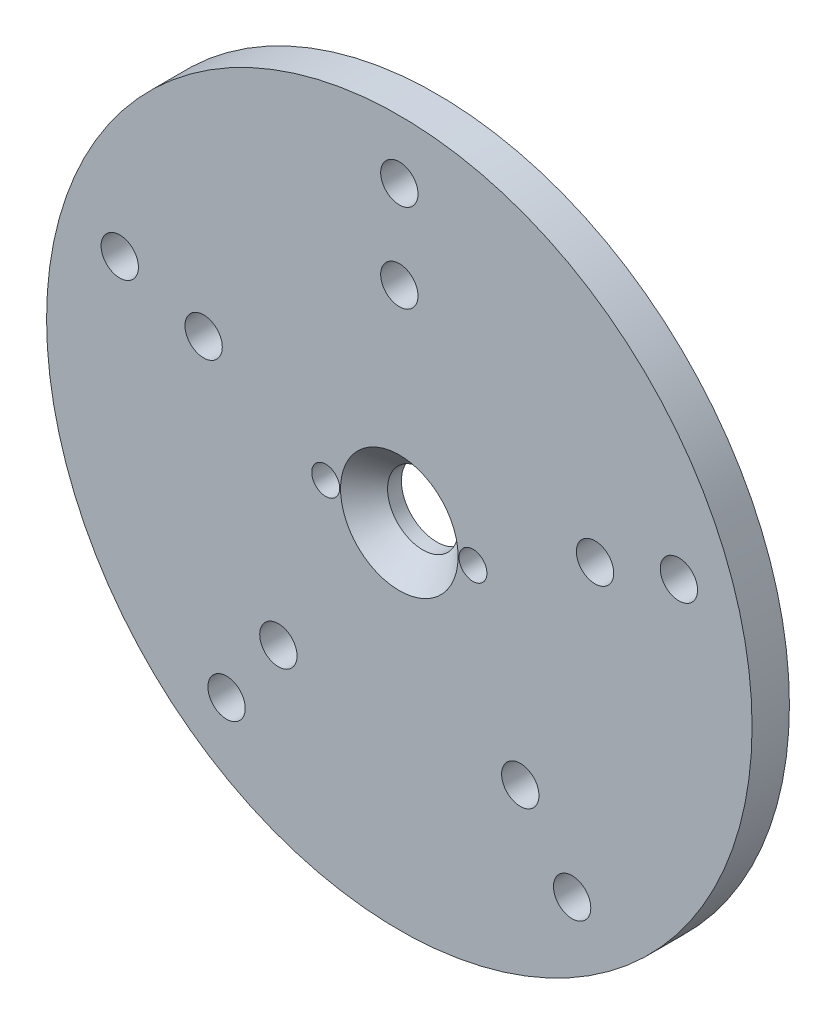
ISO-10303-21;
HEADER;
FILE_DESCRIPTION(('STEP AP214'),'2;1');
FILE_NAME('part.step','',(''),(''),'','','');
FILE_SCHEMA(('AUTOMOTIVE_DESIGN { 1 0 10303 214 1 1 1 1 }'));
ENDSEC;
DATA;
#1=APPLICATION_CONTEXT('core data for automotive mechanical design processes');
#2=APPLICATION_PROTOCOL_DEFINITION('international standard','automotive_design',2000,#1);
#3=PRODUCT_CONTEXT('',#1,'mechanical');
#4=PRODUCT('Part','Part','',(#3));
#5=PRODUCT_RELATED_PRODUCT_CATEGORY('part','',(#4));
#6=PRODUCT_DEFINITION_FORMATION('','',#4);
#7=PRODUCT_DEFINITION_CONTEXT('part definition',#1,'design');
#8=PRODUCT_DEFINITION('design','',#6,#7);
#9=PRODUCT_DEFINITION_SHAPE('','',#8);
#10=(LENGTH_UNIT() NAMED_UNIT(*) SI_UNIT(.MILLI.,.METRE.));
#11=(NAMED_UNIT(*) PLANE_ANGLE_UNIT() SI_UNIT($,.RADIAN.));
#12=(NAMED_UNIT(*) SI_UNIT($,.STERADIAN.) SOLID_ANGLE_UNIT());
#13=UNCERTAINTY_MEASURE_WITH_UNIT(LENGTH_MEASURE(1.E-05),#10,'distance_accuracy_value','');
#14=(GEOMETRIC_REPRESENTATION_CONTEXT(3) GLOBAL_UNCERTAINTY_ASSIGNED_CONTEXT((#13)) GLOBAL_UNIT_ASSIGNED_CONTEXT((#10,
#11,#12)) REPRESENTATION_CONTEXT('',''));
#15=CARTESIAN_POINT('',(0.,0.,0.));
#16=DIRECTION('',(0.,0.,1.));
#17=DIRECTION('',(1.,0.,0.));
#18=AXIS2_PLACEMENT_3D('',#15,#16,#17);
#19=CARTESIAN_POINT('',(0.,0.,6.35));
#20=DIRECTION('',(0.,0.,1.));
#21=DIRECTION('',(1.,0.,0.));
#22=AXIS2_PLACEMENT_3D('',#19,#20,#21);
#23=PLANE('',#22);
#24=CARTESIAN_POINT('',(-33.2869780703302,10.8155948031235,6.35));
#25=DIRECTION('',(0.,0.,1.));
#26=DIRECTION('',(0.309016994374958,0.95105651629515,0.));
#27=AXIS2_PLACEMENT_3D('',#24,#25,#26);
#28=CIRCLE('',#27,3.175);
#29=CARTESIAN_POINT('',(-32.3058491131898,13.8351992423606,6.35));
#30=VERTEX_POINT('',#29);
#31=EDGE_CURVE('E117',#30,#30,#28,.T.);
#32=ORIENTED_EDGE('',*,*,#31,.F.);
#33=EDGE_LOOP('',(#32));
#34=FACE_BOUND('',#33,.T.);
#35=CARTESIAN_POINT('',(-47.5528258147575,15.4508497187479,6.35));
#36=DIRECTION('',(0.,0.,1.));
#37=DIRECTION('',(0.309016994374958,0.95105651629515,0.));
#38=AXIS2_PLACEMENT_3D('',#35,#36,#37);
#39=CIRCLE('',#38,3.175);
#40=CARTESIAN_POINT('',(-46.571696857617,18.470454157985,6.35));
#41=VERTEX_POINT('',#40);
#42=EDGE_CURVE('E111',#41,#41,#39,.T.);
#43=ORIENTED_EDGE('',*,*,#42,.F.);
#44=EDGE_LOOP('',(#43));
#45=FACE_BOUND('',#44,.T.);
#46=CARTESIAN_POINT('',(-20.5724838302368,-28.315594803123,6.35));
#47=DIRECTION('',(0.,0.,1.));
#48=DIRECTION('',(-0.809016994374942,0.58778525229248,0.));
#49=AXIS2_PLACEMENT_3D('',#46,#47,#48);
#50=CIRCLE('',#49,3.175);
#51=CARTESIAN_POINT('',(-23.1411127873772,-26.4493766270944,6.35));
#52=VERTEX_POINT('',#51);
#53=EDGE_CURVE('E105',#52,#52,#50,.T.);
#54=ORIENTED_EDGE('',*,*,#53,.F.);
#55=EDGE_LOOP('',(#54));
#56=FACE_BOUND('',#55,.T.);
#57=CARTESIAN_POINT('',(-29.389262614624,-40.4508497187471,6.35));
#58=DIRECTION('',(0.,0.,1.));
#59=DIRECTION('',(-0.809016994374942,0.58778525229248,0.));
#60=AXIS2_PLACEMENT_3D('',#57,#58,#59);
#61=CIRCLE('',#60,3.175);
#62=CARTESIAN_POINT('',(-31.9578915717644,-38.5846315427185,6.35));
#63=VERTEX_POINT('',#62);
#64=EDGE_CURVE('E99',#63,#63,#61,.T.);
#65=ORIENTED_EDGE('',*,*,#64,.F.);
#66=EDGE_LOOP('',(#65));
#67=FACE_BOUND('',#66,.T.);
#68=CARTESIAN_POINT('',(20.5724838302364,-28.3155948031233,6.35));
#69=DIRECTION('',(0.,0.,1.));
#70=DIRECTION('',(-0.809016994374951,-0.587785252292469,0.));
#71=AXIS2_PLACEMENT_3D('',#68,#69,#70);
#72=CIRCLE('',#71,3.175);
#73=CARTESIAN_POINT('',(18.0038548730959,-30.1818129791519,6.35));
#74=VERTEX_POINT('',#73);
#75=EDGE_CURVE('E93',#74,#74,#72,.T.);
#76=ORIENTED_EDGE('',*,*,#75,.F.);
#77=EDGE_LOOP('',(#76));
#78=FACE_BOUND('',#77,.T.);
#79=CARTESIAN_POINT('',(29.3892626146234,-40.4508497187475,6.35));
#80=DIRECTION('',(0.,0.,1.));
#81=DIRECTION('',(-0.809016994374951,-0.587785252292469,0.));
#82=AXIS2_PLACEMENT_3D('',#79,#80,#81);
#83=CIRCLE('',#82,3.175);
#84=CARTESIAN_POINT('',(26.820633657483,-42.3170678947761,6.35));
#85=VERTEX_POINT('',#84);
#86=EDGE_CURVE('E87',#85,#85,#83,.T.);
#87=ORIENTED_EDGE('',*,*,#86,.F.);
#88=EDGE_LOOP('',(#87));
#89=FACE_BOUND('',#88,.T.);
#90=CARTESIAN_POINT('',(33.2869780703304,10.8155948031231,6.35));
#91=DIRECTION('',(0.,0.,1.));
#92=DIRECTION('',(0.309016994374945,-0.951056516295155,0.));
#93=AXIS2_PLACEMENT_3D('',#90,#91,#92);
#94=CIRCLE('',#93,3.175);
#95=CARTESIAN_POINT('',(34.2681070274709,7.79599036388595,6.35));
#96=VERTEX_POINT('',#95);
#97=EDGE_CURVE('E81',#96,#96,#94,.T.);
#98=ORIENTED_EDGE('',*,*,#97,.F.);
#99=EDGE_LOOP('',(#98));
#100=FACE_BOUND('',#99,.T.);
#101=CARTESIAN_POINT('',(47.5528258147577,15.4508497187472,6.35));
#102=DIRECTION('',(0.,0.,1.));
#103=DIRECTION('',(0.309016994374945,-0.951056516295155,0.));
#104=AXIS2_PLACEMENT_3D('',#101,#102,#103);
#105=CIRCLE('',#104,3.175);
#106=CARTESIAN_POINT('',(48.5339547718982,12.4312452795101,6.35));
#107=VERTEX_POINT('',#106);
#108=EDGE_CURVE('E75',#107,#107,#105,.T.);
#109=ORIENTED_EDGE('',*,*,#108,.F.);
#110=EDGE_LOOP('',(#109));
#111=FACE_BOUND('',#110,.T.);
#112=CARTESIAN_POINT('',(0.,35.,6.35));
#113=DIRECTION('',(0.,0.,1.));
#114=DIRECTION('',(1.,0.,0.));
#115=AXIS2_PLACEMENT_3D('',#112,#113,#114);
#116=CIRCLE('',#115,3.175);
#117=CARTESIAN_POINT('',(3.175,35.,6.35));
#118=VERTEX_POINT('',#117);
#119=EDGE_CURVE('E69',#118,#118,#116,.T.);
#120=ORIENTED_EDGE('',*,*,#119,.F.);
#121=EDGE_LOOP('',(#120));
#122=FACE_BOUND('',#121,.T.);
#123=CARTESIAN_POINT('',(0.,50.,6.35));
#124=DIRECTION('',(0.,0.,1.));
#125=DIRECTION('',(1.,0.,0.));
#126=AXIS2_PLACEMENT_3D('',#123,#124,#125);
#127=CIRCLE('',#126,3.175);
#128=CARTESIAN_POINT('',(3.175,50.,6.35));
#129=VERTEX_POINT('',#128);
#130=EDGE_CURVE('E63',#129,#129,#127,.T.);
#131=ORIENTED_EDGE('',*,*,#130,.F.);
#132=EDGE_LOOP('',(#131));
#133=FACE_BOUND('',#132,.T.);
#134=CARTESIAN_POINT('',(0.,0.,6.35));
#135=DIRECTION('',(0.,0.,1.));
#136=DIRECTION('',(1.,0.,0.));
#137=AXIS2_PLACEMENT_3D('',#134,#135,#136);
#138=CIRCLE('',#137,9.99999999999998);
#139=CARTESIAN_POINT('',(9.99999999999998,0.,6.35));
#140=VERTEX_POINT('',#139);
#141=EDGE_CURVE('E10',#140,#140,#138,.F.);
#142=ORIENTED_EDGE('',*,*,#141,.T.);
#143=EDGE_LOOP('',(#142));
#144=FACE_BOUND('',#143,.T.);
#145=CARTESIAN_POINT('',(-12.525,0.,6.35));
#146=DIRECTION('',(0.,0.,1.));
#147=DIRECTION('',(1.,0.,0.));
#148=AXIS2_PLACEMENT_3D('',#145,#146,#147);
#149=CIRCLE('',#148,2.375);
#150=CARTESIAN_POINT('',(-10.15,0.,6.35));
#151=VERTEX_POINT('',#150);
#152=EDGE_CURVE('E48',#151,#151,#149,.T.);
#153=ORIENTED_EDGE('',*,*,#152,.F.);
#154=EDGE_LOOP('',(#153));
#155=FACE_BOUND('',#154,.T.);
#156=CARTESIAN_POINT('',(0.,0.,6.35));
#157=DIRECTION('',(0.,0.,1.));
#158=DIRECTION('',(1.,0.,0.));
#159=AXIS2_PLACEMENT_3D('',#156,#157,#158);
#160=CIRCLE('',#159,60.);
#161=CARTESIAN_POINT('',(60.,0.,6.35));
#162=VERTEX_POINT('',#161);
#163=EDGE_CURVE('E36',#162,#162,#160,.T.);
#164=ORIENTED_EDGE('',*,*,#163,.T.);
#165=EDGE_LOOP('',(#164));
#166=FACE_BOUND('',#165,.T.);
#167=CARTESIAN_POINT('',(12.525,0.,6.35));
#168=DIRECTION('',(0.,0.,1.));
#169=DIRECTION('',(1.,0.,0.));
#170=AXIS2_PLACEMENT_3D('',#167,#168,#169);
#171=CIRCLE('',#170,2.375);
#172=CARTESIAN_POINT('',(14.9,0.,6.35));
#173=VERTEX_POINT('',#172);
#174=EDGE_CURVE('E54',#173,#173,#171,.T.);
#175=ORIENTED_EDGE('',*,*,#174,.F.);
#176=EDGE_LOOP('',(#175));
#177=FACE_BOUND('',#176,.T.);
#178=ADVANCED_FACE('F25',(#34,#45,#56,#67,#78,#89,#100,#111,#122,#133,#144,#155,#166,#177),#23,.T.);
#179=CARTESIAN_POINT('',(0.,0.,0.));
#180=DIRECTION('',(0.,0.,1.));
#181=DIRECTION('',(1.,0.,0.));
#182=AXIS2_PLACEMENT_3D('',#179,#180,#181);
#183=PLANE('',#182);
#184=CARTESIAN_POINT('',(-33.2869780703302,10.8155948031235,0.));
#185=DIRECTION('',(0.,0.,1.));
#186=DIRECTION('',(1.,0.,0.));
#187=AXIS2_PLACEMENT_3D('',#184,#185,#186);
#188=CIRCLE('',#187,3.175);
#189=CARTESIAN_POINT('',(-30.1119780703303,10.8155948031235,0.));
#190=VERTEX_POINT('',#189);
#191=EDGE_CURVE('E114',#190,#190,#188,.F.);
#192=ORIENTED_EDGE('',*,*,#191,.F.);
#193=EDGE_LOOP('',(#192));
#194=FACE_BOUND('',#193,.T.);
#195=CARTESIAN_POINT('',(-47.5528258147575,15.4508497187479,0.));
#196=DIRECTION('',(0.,0.,1.));
#197=DIRECTION('',(1.,0.,0.));
#198=AXIS2_PLACEMENT_3D('',#195,#196,#197);
#199=CIRCLE('',#198,3.175);
#200=CARTESIAN_POINT('',(-44.3778258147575,15.4508497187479,0.));
#201=VERTEX_POINT('',#200);
#202=EDGE_CURVE('E108',#201,#201,#199,.F.);
#203=ORIENTED_EDGE('',*,*,#202,.F.);
#204=EDGE_LOOP('',(#203));
#205=FACE_BOUND('',#204,.T.);
#206=CARTESIAN_POINT('',(-20.5724838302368,-28.315594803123,0.));
#207=DIRECTION('',(0.,0.,1.));
#208=DIRECTION('',(1.,0.,0.));
#209=AXIS2_PLACEMENT_3D('',#206,#207,#208);
#210=CIRCLE('',#209,3.175);
#211=CARTESIAN_POINT('',(-17.3974838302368,-28.315594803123,0.));
#212=VERTEX_POINT('',#211);
#213=EDGE_CURVE('E102',#212,#212,#210,.F.);
#214=ORIENTED_EDGE('',*,*,#213,.F.);
#215=EDGE_LOOP('',(#214));
#216=FACE_BOUND('',#215,.T.);
#217=CARTESIAN_POINT('',(-29.389262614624,-40.4508497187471,0.));
#218=DIRECTION('',(0.,0.,1.));
#219=DIRECTION('',(1.,0.,0.));
#220=AXIS2_PLACEMENT_3D('',#217,#218,#219);
#221=CIRCLE('',#220,3.175);
#222=CARTESIAN_POINT('',(-26.214262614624,-40.4508497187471,0.));
#223=VERTEX_POINT('',#222);
#224=EDGE_CURVE('E96',#223,#223,#221,.F.);
#225=ORIENTED_EDGE('',*,*,#224,.F.);
#226=EDGE_LOOP('',(#225));
#227=FACE_BOUND('',#226,.T.);
#228=CARTESIAN_POINT('',(20.5724838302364,-28.3155948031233,0.));
#229=DIRECTION('',(0.,0.,1.));
#230=DIRECTION('',(1.,0.,0.));
#231=AXIS2_PLACEMENT_3D('',#228,#229,#230);
#232=CIRCLE('',#231,3.175);
#233=CARTESIAN_POINT('',(23.7474838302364,-28.3155948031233,0.));
#234=VERTEX_POINT('',#233);
#235=EDGE_CURVE('E90',#234,#234,#232,.F.);
#236=ORIENTED_EDGE('',*,*,#235,.F.);
#237=EDGE_LOOP('',(#236));
#238=FACE_BOUND('',#237,.T.);
#239=CARTESIAN_POINT('',(29.3892626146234,-40.4508497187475,0.));
#240=DIRECTION('',(0.,0.,1.));
#241=DIRECTION('',(1.,0.,0.));
#242=AXIS2_PLACEMENT_3D('',#239,#240,#241);
#243=CIRCLE('',#242,3.175);
#244=CARTESIAN_POINT('',(32.5642626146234,-40.4508497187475,0.));
#245=VERTEX_POINT('',#244);
#246=EDGE_CURVE('E84',#245,#245,#243,.F.);
#247=ORIENTED_EDGE('',*,*,#246,.F.);
#248=EDGE_LOOP('',(#247));
#249=FACE_BOUND('',#248,.T.);
#250=CARTESIAN_POINT('',(33.2869780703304,10.8155948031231,0.));
#251=DIRECTION('',(0.,0.,1.));
#252=DIRECTION('',(1.,0.,0.));
#253=AXIS2_PLACEMENT_3D('',#250,#251,#252);
#254=CIRCLE('',#253,3.175);
#255=CARTESIAN_POINT('',(36.4619780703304,10.8155948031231,0.));
#256=VERTEX_POINT('',#255);
#257=EDGE_CURVE('E78',#256,#256,#254,.F.);
#258=ORIENTED_EDGE('',*,*,#257,.F.);
#259=EDGE_LOOP('',(#258));
#260=FACE_BOUND('',#259,.T.);
#261=CARTESIAN_POINT('',(47.5528258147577,15.4508497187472,0.));
#262=DIRECTION('',(0.,0.,1.));
#263=DIRECTION('',(1.,0.,0.));
#264=AXIS2_PLACEMENT_3D('',#261,#262,#263);
#265=CIRCLE('',#264,3.175);
#266=CARTESIAN_POINT('',(50.7278258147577,15.4508497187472,0.));
#267=VERTEX_POINT('',#266);
#268=EDGE_CURVE('E72',#267,#267,#265,.F.);
#269=ORIENTED_EDGE('',*,*,#268,.F.);
#270=EDGE_LOOP('',(#269));
#271=FACE_BOUND('',#270,.T.);
#272=CARTESIAN_POINT('',(0.,35.,0.));
#273=DIRECTION('',(0.,0.,1.));
#274=DIRECTION('',(1.,0.,0.));
#275=AXIS2_PLACEMENT_3D('',#272,#273,#274);
#276=CIRCLE('',#275,3.175);
#277=CARTESIAN_POINT('',(3.175,35.,0.));
#278=VERTEX_POINT('',#277);
#279=EDGE_CURVE('E66',#278,#278,#276,.F.);
#280=ORIENTED_EDGE('',*,*,#279,.F.);
#281=EDGE_LOOP('',(#280));
#282=FACE_BOUND('',#281,.T.);
#283=CARTESIAN_POINT('',(0.,50.,0.));
#284=DIRECTION('',(0.,0.,1.));
#285=DIRECTION('',(1.,0.,0.));
#286=AXIS2_PLACEMENT_3D('',#283,#284,#285);
#287=CIRCLE('',#286,3.175);
#288=CARTESIAN_POINT('',(3.175,50.,0.));
#289=VERTEX_POINT('',#288);
#290=EDGE_CURVE('E60',#289,#289,#287,.F.);
#291=ORIENTED_EDGE('',*,*,#290,.F.);
#292=EDGE_LOOP('',(#291));
#293=FACE_BOUND('',#292,.T.);
#294=CARTESIAN_POINT('',(-12.525,0.,0.));
#295=DIRECTION('',(0.,0.,1.));
#296=DIRECTION('',(1.,0.,0.));
#297=AXIS2_PLACEMENT_3D('',#294,#295,#296);
#298=CIRCLE('',#297,2.375);
#299=CARTESIAN_POINT('',(-10.15,0.,0.));
#300=VERTEX_POINT('',#299);
#301=EDGE_CURVE('E51',#300,#300,#298,.T.);
#302=ORIENTED_EDGE('',*,*,#301,.T.);
#303=EDGE_LOOP('',(#302));
#304=FACE_BOUND('',#303,.T.);
#305=CARTESIAN_POINT('',(0.,0.,0.));
#306=DIRECTION('',(0.,0.,1.));
#307=DIRECTION('',(1.,0.,0.));
#308=AXIS2_PLACEMENT_3D('',#305,#306,#307);
#309=CIRCLE('',#308,60.);
#310=CARTESIAN_POINT('',(60.,0.,0.));
#311=VERTEX_POINT('',#310);
#312=EDGE_CURVE('E40',#311,#311,#309,.T.);
#313=ORIENTED_EDGE('',*,*,#312,.F.);
#314=EDGE_LOOP('',(#313));
#315=FACE_BOUND('',#314,.T.);
#316=CARTESIAN_POINT('',(0.,0.,0.));
#317=DIRECTION('',(0.,0.,1.));
#318=DIRECTION('',(1.,0.,0.));
#319=AXIS2_PLACEMENT_3D('',#316,#317,#318);
#320=CIRCLE('',#319,6.);
#321=CARTESIAN_POINT('',(6.,0.,0.));
#322=VERTEX_POINT('',#321);
#323=EDGE_CURVE('E45',#322,#322,#320,.T.);
#324=ORIENTED_EDGE('',*,*,#323,.T.);
#325=EDGE_LOOP('',(#324));
#326=FACE_BOUND('',#325,.T.);
#327=CARTESIAN_POINT('',(12.525,0.,0.));
#328=DIRECTION('',(0.,0.,1.));
#329=DIRECTION('',(1.,0.,0.));
#330=AXIS2_PLACEMENT_3D('',#327,#328,#329);
#331=CIRCLE('',#330,2.375);
#332=CARTESIAN_POINT('',(14.9,0.,0.));
#333=VERTEX_POINT('',#332);
#334=EDGE_CURVE('E57',#333,#333,#331,.T.);
#335=ORIENTED_EDGE('',*,*,#334,.T.);
#336=EDGE_LOOP('',(#335));
#337=FACE_BOUND('',#336,.T.);
#338=ADVANCED_FACE('F126',(#194,#205,#216,#227,#238,#249,#260,#271,#282,#293,#304,#315,#326,
#337),#183,.F.);
#339=CARTESIAN_POINT('',(0.,0.,6.35));
#340=DIRECTION('',(0.,0.,-1.));
#341=DIRECTION('',(-1.,0.,0.));
#342=AXIS2_PLACEMENT_3D('',#339,#340,#341);
#343=CYLINDRICAL_SURFACE('',#342,60.);
#344=ORIENTED_EDGE('',*,*,#163,.F.);
#345=EDGE_LOOP('',(#344));
#346=FACE_BOUND('',#345,.T.);
#347=ORIENTED_EDGE('',*,*,#312,.T.);
#348=EDGE_LOOP('',(#347));
#349=FACE_BOUND('',#348,.T.);
#350=ADVANCED_FACE('F27',(#346,#349),#343,.T.);
#351=CARTESIAN_POINT('',(0.,0.,6.35));
#352=DIRECTION('',(0.,0.,-1.));
#353=DIRECTION('',(-1.,0.,0.));
#354=AXIS2_PLACEMENT_3D('',#351,#352,#353);
#355=CYLINDRICAL_SURFACE('',#354,6.);
#356=CARTESIAN_POINT('',(0.,0.,2.35000000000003));
#357=DIRECTION('',(0.,0.,1.));
#358=DIRECTION('',(1.,0.,0.));
#359=AXIS2_PLACEMENT_3D('',#356,#357,#358);
#360=CIRCLE('',#359,6.);
#361=CARTESIAN_POINT('',(6.,0.,2.35000000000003));
#362=VERTEX_POINT('',#361);
#363=EDGE_CURVE('E32',#362,#362,#360,.T.);
#364=ORIENTED_EDGE('',*,*,#363,.T.);
#365=EDGE_LOOP('',(#364));
#366=FACE_BOUND('',#365,.T.);
#367=ORIENTED_EDGE('',*,*,#323,.F.);
#368=EDGE_LOOP('',(#367));
#369=FACE_BOUND('',#368,.T.);
#370=ADVANCED_FACE('F166',(#366,#369),#355,.F.);
#371=CARTESIAN_POINT('',(-12.525,0.,6.35));
#372=DIRECTION('',(0.,0.,-1.));
#373=DIRECTION('',(-1.,0.,0.));
#374=AXIS2_PLACEMENT_3D('',#371,#372,#373);
#375=CYLINDRICAL_SURFACE('',#374,2.375);
#376=ORIENTED_EDGE('',*,*,#152,.T.);
#377=EDGE_LOOP('',(#376));
#378=FACE_BOUND('',#377,.T.);
#379=ORIENTED_EDGE('',*,*,#301,.F.);
#380=EDGE_LOOP('',(#379));
#381=FACE_BOUND('',#380,.T.);
#382=ADVANCED_FACE('F155',(#378,#381),#375,.F.);
#383=CARTESIAN_POINT('',(12.525,0.,6.35));
#384=DIRECTION('',(0.,0.,-1.));
#385=DIRECTION('',(-1.,0.,0.));
#386=AXIS2_PLACEMENT_3D('',#383,#384,#385);
#387=CYLINDRICAL_SURFACE('',#386,2.375);
#388=ORIENTED_EDGE('',*,*,#174,.T.);
#389=EDGE_LOOP('',(#388));
#390=FACE_BOUND('',#389,.T.);
#391=ORIENTED_EDGE('',*,*,#334,.F.);
#392=EDGE_LOOP('',(#391));
#393=FACE_BOUND('',#392,.T.);
#394=ADVANCED_FACE('F151',(#390,#393),#387,.F.);
#395=CARTESIAN_POINT('',(0.,0.,2.35000000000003));
#396=DIRECTION('',(0.,0.,1.));
#397=DIRECTION('',(1.,0.,0.));
#398=AXIS2_PLACEMENT_3D('',#395,#396,#397);
#399=CONICAL_SURFACE('',#398,6.,0.785398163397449);
#400=ORIENTED_EDGE('',*,*,#141,.F.);
#401=EDGE_LOOP('',(#400));
#402=FACE_BOUND('',#401,.T.);
#403=ORIENTED_EDGE('',*,*,#363,.F.);
#404=EDGE_LOOP('',(#403));
#405=FACE_BOUND('',#404,.T.);
#406=ADVANCED_FACE('F154',(#402,#405),#399,.F.);
#407=CARTESIAN_POINT('',(0.,50.,-0.00100000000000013));
#408=DIRECTION('',(0.,0.,1.));
#409=DIRECTION('',(1.,0.,0.));
#410=AXIS2_PLACEMENT_3D('',#407,#408,#409);
#411=CYLINDRICAL_SURFACE('',#410,3.175);
#412=ORIENTED_EDGE('',*,*,#130,.T.);
#413=EDGE_LOOP('',(#412));
#414=FACE_BOUND('',#413,.T.);
#415=ORIENTED_EDGE('',*,*,#290,.T.);
#416=EDGE_LOOP('',(#415));
#417=FACE_BOUND('',#416,.T.);
#418=ADVANCED_FACE('F178',(#414,#417),#411,.F.);
#419=CARTESIAN_POINT('',(0.,35.,-0.00100000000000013));
#420=DIRECTION('',(0.,0.,1.));
#421=DIRECTION('',(1.,0.,0.));
#422=AXIS2_PLACEMENT_3D('',#419,#420,#421);
#423=CYLINDRICAL_SURFACE('',#422,3.175);
#424=ORIENTED_EDGE('',*,*,#119,.T.);
#425=EDGE_LOOP('',(#424));
#426=FACE_BOUND('',#425,.T.);
#427=ORIENTED_EDGE('',*,*,#279,.T.);
#428=EDGE_LOOP('',(#427));
#429=FACE_BOUND('',#428,.T.);
#430=ADVANCED_FACE('F182',(#426,#429),#423,.F.);
#431=CARTESIAN_POINT('',(47.5528258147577,15.4508497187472,-0.00100000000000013));
#432=DIRECTION('',(0.,0.,1.));
#433=DIRECTION('',(1.,0.,0.));
#434=AXIS2_PLACEMENT_3D('',#431,#432,#433);
#435=CYLINDRICAL_SURFACE('',#434,3.175);
#436=ORIENTED_EDGE('',*,*,#108,.T.);
#437=EDGE_LOOP('',(#436));
#438=FACE_BOUND('',#437,.T.);
#439=ORIENTED_EDGE('',*,*,#268,.T.);
#440=EDGE_LOOP('',(#439));
#441=FACE_BOUND('',#440,.T.);
#442=ADVANCED_FACE('F186',(#438,#441),#435,.F.);
#443=CARTESIAN_POINT('',(33.2869780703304,10.8155948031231,-0.00100000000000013));
#444=DIRECTION('',(0.,0.,1.));
#445=DIRECTION('',(1.,0.,0.));
#446=AXIS2_PLACEMENT_3D('',#443,#444,#445);
#447=CYLINDRICAL_SURFACE('',#446,3.175);
#448=ORIENTED_EDGE('',*,*,#97,.T.);
#449=EDGE_LOOP('',(#448));
#450=FACE_BOUND('',#449,.T.);
#451=ORIENTED_EDGE('',*,*,#257,.T.);
#452=EDGE_LOOP('',(#451));
#453=FACE_BOUND('',#452,.T.);
#454=ADVANCED_FACE('F189',(#450,#453),#447,.F.);
#455=CARTESIAN_POINT('',(29.3892626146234,-40.4508497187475,-0.00100000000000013));
#456=DIRECTION('',(0.,0.,1.));
#457=DIRECTION('',(1.,0.,0.));
#458=AXIS2_PLACEMENT_3D('',#455,#456,#457);
#459=CYLINDRICAL_SURFACE('',#458,3.175);
#460=ORIENTED_EDGE('',*,*,#86,.T.);
#461=EDGE_LOOP('',(#460));
#462=FACE_BOUND('',#461,.T.);
#463=ORIENTED_EDGE('',*,*,#246,.T.);
#464=EDGE_LOOP('',(#463));
#465=FACE_BOUND('',#464,.T.);
#466=ADVANCED_FACE('F193',(#462,#465),#459,.F.);
#467=CARTESIAN_POINT('',(20.5724838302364,-28.3155948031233,-0.00100000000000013));
#468=DIRECTION('',(0.,0.,1.));
#469=DIRECTION('',(1.,0.,0.));
#470=AXIS2_PLACEMENT_3D('',#467,#468,#469);
#471=CYLINDRICAL_SURFACE('',#470,3.175);
#472=ORIENTED_EDGE('',*,*,#75,.T.);
#473=EDGE_LOOP('',(#472));
#474=FACE_BOUND('',#473,.T.);
#475=ORIENTED_EDGE('',*,*,#235,.T.);
#476=EDGE_LOOP('',(#475));
#477=FACE_BOUND('',#476,.T.);
#478=ADVANCED_FACE('F197',(#474,#477),#471,.F.);
#479=CARTESIAN_POINT('',(-29.389262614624,-40.4508497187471,-0.00100000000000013));
#480=DIRECTION('',(0.,0.,1.));
#481=DIRECTION('',(1.,0.,0.));
#482=AXIS2_PLACEMENT_3D('',#479,#480,#481);
#483=CYLINDRICAL_SURFACE('',#482,3.175);
#484=ORIENTED_EDGE('',*,*,#64,.T.);
#485=EDGE_LOOP('',(#484));
#486=FACE_BOUND('',#485,.T.);
#487=ORIENTED_EDGE('',*,*,#224,.T.);
#488=EDGE_LOOP('',(#487));
#489=FACE_BOUND('',#488,.T.);
#490=ADVANCED_FACE('F201',(#486,#489),#483,.F.);
#491=CARTESIAN_POINT('',(-20.5724838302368,-28.315594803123,-0.00100000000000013));
#492=DIRECTION('',(0.,0.,1.));
#493=DIRECTION('',(1.,0.,0.));
#494=AXIS2_PLACEMENT_3D('',#491,#492,#493);
#495=CYLINDRICAL_SURFACE('',#494,3.175);
#496=ORIENTED_EDGE('',*,*,#53,.T.);
#497=EDGE_LOOP('',(#496));
#498=FACE_BOUND('',#497,.T.);
#499=ORIENTED_EDGE('',*,*,#213,.T.);
#500=EDGE_LOOP('',(#499));
#501=FACE_BOUND('',#500,.T.);
#502=ADVANCED_FACE('F205',(#498,#501),#495,.F.);
#503=CARTESIAN_POINT('',(-47.5528258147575,15.4508497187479,-0.00100000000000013));
#504=DIRECTION('',(0.,0.,1.));
#505=DIRECTION('',(1.,0.,0.));
#506=AXIS2_PLACEMENT_3D('',#503,#504,#505);
#507=CYLINDRICAL_SURFACE('',#506,3.175);
#508=ORIENTED_EDGE('',*,*,#42,.T.);
#509=EDGE_LOOP('',(#508));
#510=FACE_BOUND('',#509,.T.);
#511=ORIENTED_EDGE('',*,*,#202,.T.);
#512=EDGE_LOOP('',(#511));
#513=FACE_BOUND('',#512,.T.);
#514=ADVANCED_FACE('F209',(#510,#513),#507,.F.);
#515=CARTESIAN_POINT('',(-33.2869780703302,10.8155948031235,-0.00100000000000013));
#516=DIRECTION('',(0.,0.,1.));
#517=DIRECTION('',(1.,0.,0.));
#518=AXIS2_PLACEMENT_3D('',#515,#516,#517);
#519=CYLINDRICAL_SURFACE('',#518,3.175);
#520=ORIENTED_EDGE('',*,*,#31,.T.);
#521=EDGE_LOOP('',(#520));
#522=FACE_BOUND('',#521,.T.);
#523=ORIENTED_EDGE('',*,*,#191,.T.);
#524=EDGE_LOOP('',(#523));
#525=FACE_BOUND('',#524,.T.);
#526=ADVANCED_FACE('F121',(#522,#525),#519,.F.);
#527=CLOSED_SHELL('',(#178,#338,#350,#370,#382,#394,#406,#418,#430,#442,#454,#466,#478,#490,
#502,#514,#526));
#528=MANIFOLD_SOLID_BREP('B2',#527);
#529=ADVANCED_BREP_SHAPE_REPRESENTATION('',(#18,#528),#14);
#530=SHAPE_DEFINITION_REPRESENTATION(#9,#529);
ENDSEC;
END-ISO-10303-21;
